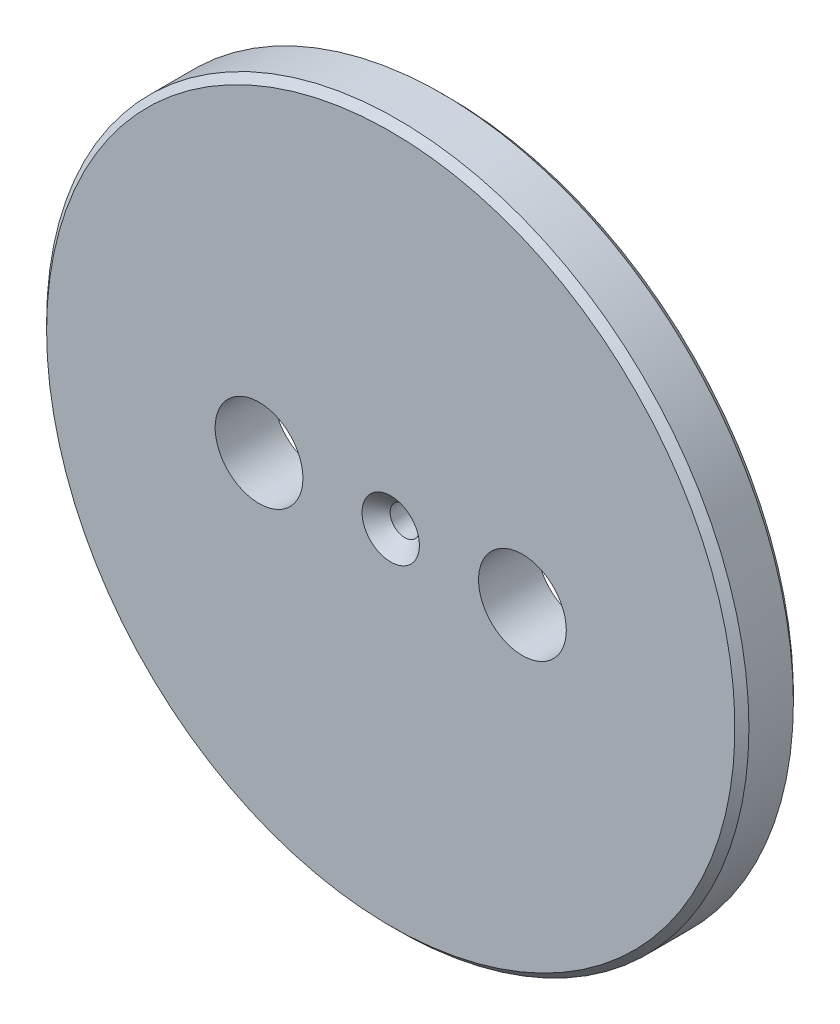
ISO-10303-21;
HEADER;
FILE_DESCRIPTION(('STEP AP214'),'2;1');
FILE_NAME('part.step','',(''),(''),'','','');
FILE_SCHEMA(('AUTOMOTIVE_DESIGN { 1 0 10303 214 1 1 1 1 }'));
ENDSEC;
DATA;
#1=APPLICATION_CONTEXT('core data for automotive mechanical design processes');
#2=APPLICATION_PROTOCOL_DEFINITION('international standard','automotive_design',2000,#1);
#3=PRODUCT_CONTEXT('',#1,'mechanical');
#4=PRODUCT('Part','Part','',(#3));
#5=PRODUCT_RELATED_PRODUCT_CATEGORY('part','',(#4));
#6=PRODUCT_DEFINITION_FORMATION('','',#4);
#7=PRODUCT_DEFINITION_CONTEXT('part definition',#1,'design');
#8=PRODUCT_DEFINITION('design','',#6,#7);
#9=PRODUCT_DEFINITION_SHAPE('','',#8);
#10=(LENGTH_UNIT() NAMED_UNIT(*) SI_UNIT(.MILLI.,.METRE.));
#11=(NAMED_UNIT(*) PLANE_ANGLE_UNIT() SI_UNIT($,.RADIAN.));
#12=(NAMED_UNIT(*) SI_UNIT($,.STERADIAN.) SOLID_ANGLE_UNIT());
#13=UNCERTAINTY_MEASURE_WITH_UNIT(LENGTH_MEASURE(1.E-05),#10,'distance_accuracy_value','');
#14=(GEOMETRIC_REPRESENTATION_CONTEXT(3) GLOBAL_UNCERTAINTY_ASSIGNED_CONTEXT((#13)) GLOBAL_UNIT_ASSIGNED_CONTEXT((#10,
#11,#12)) REPRESENTATION_CONTEXT('',''));
#15=CARTESIAN_POINT('',(0.,0.,0.));
#16=DIRECTION('',(0.,0.,1.));
#17=DIRECTION('',(1.,0.,0.));
#18=AXIS2_PLACEMENT_3D('',#15,#16,#17);
#19=CARTESIAN_POINT('',(0.,0.,4.7625));
#20=DIRECTION('',(0.,0.,0.999999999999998));
#21=DIRECTION('',(1.,0.,0.));
#22=AXIS2_PLACEMENT_3D('',#19,#20,#21);
#23=PLANE('',#22);
#24=CARTESIAN_POINT('',(14.2875,0.,4.7625));
#25=DIRECTION('',(0.,0.,0.999999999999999));
#26=DIRECTION('',(1.,0.,0.));
#27=AXIS2_PLACEMENT_3D('',#24,#25,#26);
#28=CIRCLE('',#27,4.7625);
#29=CARTESIAN_POINT('',(19.05,0.,4.7625));
#30=VERTEX_POINT('',#29);
#31=EDGE_CURVE('E75',#30,#30,#28,.T.);
#32=ORIENTED_EDGE('',*,*,#31,.F.);
#33=EDGE_LOOP('',(#32));
#34=FACE_BOUND('',#33,.T.);
#35=CARTESIAN_POINT('',(-14.2875,0.,4.7625));
#36=DIRECTION('',(0.,0.,0.999999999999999));
#37=DIRECTION('',(1.,0.,0.));
#38=AXIS2_PLACEMENT_3D('',#35,#36,#37);
#39=CIRCLE('',#38,4.7625);
#40=CARTESIAN_POINT('',(-9.525,0.,4.7625));
#41=VERTEX_POINT('',#40);
#42=EDGE_CURVE('E69',#41,#41,#39,.T.);
#43=ORIENTED_EDGE('',*,*,#42,.F.);
#44=EDGE_LOOP('',(#43));
#45=FACE_BOUND('',#44,.T.);
#46=CARTESIAN_POINT('',(0.,0.,4.7625));
#47=DIRECTION('',(0.,0.,0.999999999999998));
#48=DIRECTION('',(1.,0.,0.));
#49=AXIS2_PLACEMENT_3D('',#46,#47,#48);
#50=CIRCLE('',#49,37.338);
#51=CARTESIAN_POINT('',(-37.338,0.,4.7625));
#52=VERTEX_POINT('',#51);
#53=EDGE_CURVE('E10',#52,#52,#50,.T.);
#54=ORIENTED_EDGE('',*,*,#53,.T.);
#55=EDGE_LOOP('',(#54));
#56=FACE_BOUND('',#55,.T.);
#57=CARTESIAN_POINT('',(0.,0.,4.7625));
#58=DIRECTION('',(0.,0.,0.999999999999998));
#59=DIRECTION('',(1.,0.,0.));
#60=AXIS2_PLACEMENT_3D('',#57,#58,#59);
#61=CIRCLE('',#60,3.11150000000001);
#62=CARTESIAN_POINT('',(3.11150000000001,0.,4.7625));
#63=VERTEX_POINT('',#62);
#64=EDGE_CURVE('E51',#63,#63,#61,.F.);
#65=ORIENTED_EDGE('',*,*,#64,.T.);
#66=EDGE_LOOP('',(#65));
#67=FACE_BOUND('',#66,.T.);
#68=ADVANCED_FACE('F31',(#34,#45,#56,#67),#23,.T.);
#69=CARTESIAN_POINT('',(0.,0.,0.));
#70=DIRECTION('',(0.,0.,0.999999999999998));
#71=DIRECTION('',(1.,0.,0.));
#72=AXIS2_PLACEMENT_3D('',#69,#70,#71);
#73=PLANE('',#72);
#74=CARTESIAN_POINT('',(0.,0.,0.));
#75=DIRECTION('',(0.,0.,-0.999999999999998));
#76=DIRECTION('',(-1.,0.,0.));
#77=AXIS2_PLACEMENT_3D('',#74,#75,#76);
#78=CIRCLE('',#77,4.7625);
#79=CARTESIAN_POINT('',(4.7625,0.,0.));
#80=VERTEX_POINT('',#79);
#81=EDGE_CURVE('E63',#80,#80,#78,.T.);
#82=ORIENTED_EDGE('',*,*,#81,.T.);
#83=EDGE_LOOP('',(#82));
#84=FACE_BOUND('',#83,.T.);
#85=CARTESIAN_POINT('',(0.,0.,0.));
#86=DIRECTION('',(0.,0.,0.999999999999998));
#87=DIRECTION('',(1.,0.,0.));
#88=AXIS2_PLACEMENT_3D('',#85,#86,#87);
#89=CIRCLE('',#88,1.5875);
#90=CARTESIAN_POINT('',(-1.5875,0.,0.));
#91=VERTEX_POINT('',#90);
#92=EDGE_CURVE('E57',#91,#91,#89,.T.);
#93=ORIENTED_EDGE('',*,*,#92,.T.);
#94=EDGE_LOOP('',(#93));
#95=FACE_BOUND('',#94,.T.);
#96=ADVANCED_FACE('F83',(#84,#95),#73,.F.);
#97=CARTESIAN_POINT('',(0.,0.,4.7625));
#98=DIRECTION('',(0.,0.,-0.999999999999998));
#99=DIRECTION('',(-1.,0.,0.));
#100=AXIS2_PLACEMENT_3D('',#97,#98,#99);
#101=CYLINDRICAL_SURFACE('',#100,38.1);
#102=CARTESIAN_POINT('',(0.,0.,-0.825500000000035));
#103=DIRECTION('',(0.,0.,-0.999999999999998));
#104=DIRECTION('',(-1.,0.,0.));
#105=AXIS2_PLACEMENT_3D('',#102,#103,#104);
#106=CIRCLE('',#105,38.1);
#107=CARTESIAN_POINT('',(-38.1,0.,-0.825500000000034));
#108=VERTEX_POINT('',#107);
#109=EDGE_CURVE('E38',#108,#108,#106,.F.);
#110=CARTESIAN_POINT('',(0.,0.,4.00049999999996));
#111=DIRECTION('',(0.,0.,0.999999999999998));
#112=DIRECTION('',(1.,0.,0.));
#113=AXIS2_PLACEMENT_3D('',#110,#111,#112);
#114=CIRCLE('',#113,38.1);
#115=CARTESIAN_POINT('',(-38.1,0.,4.00049999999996));
#116=VERTEX_POINT('',#115);
#117=EDGE_CURVE('E42',#116,#116,#114,.F.);
#118=CARTESIAN_POINT('',(-38.1,0.,-0.825500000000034));
#119=CARTESIAN_POINT('',(-38.1,0.,-0.7752291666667));
#120=CARTESIAN_POINT('',(-38.1,0.,-0.724958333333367));
#121=CARTESIAN_POINT('',(-38.1,0.,-0.6244166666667));
#122=CARTESIAN_POINT('',(-38.1,0.,-0.574145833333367));
#123=CARTESIAN_POINT('',(-38.1,0.,-0.4736041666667));
#124=CARTESIAN_POINT('',(-38.1,0.,-0.423333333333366));
#125=CARTESIAN_POINT('',(-38.1,0.,-0.3227916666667));
#126=CARTESIAN_POINT('',(-38.1,0.,-0.272520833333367));
#127=CARTESIAN_POINT('',(-38.1,0.,-0.171979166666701));
#128=CARTESIAN_POINT('',(-38.1,0.,-0.121708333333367));
#129=CARTESIAN_POINT('',(-38.1,0.,-0.0211666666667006));
#130=CARTESIAN_POINT('',(-38.1,0.,0.029104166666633));
#131=CARTESIAN_POINT('',(-38.1,0.,0.1296458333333));
#132=CARTESIAN_POINT('',(-38.1,0.,0.179916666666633));
#133=CARTESIAN_POINT('',(-38.1,0.,0.280458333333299));
#134=CARTESIAN_POINT('',(-38.1,0.,0.330729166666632));
#135=CARTESIAN_POINT('',(-38.1,0.,0.431270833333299));
#136=CARTESIAN_POINT('',(-38.1,0.,0.481541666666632));
#137=CARTESIAN_POINT('',(-38.1,0.,0.582083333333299));
#138=CARTESIAN_POINT('',(-38.1,0.,0.632354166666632));
#139=CARTESIAN_POINT('',(-38.1,0.,0.732895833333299));
#140=CARTESIAN_POINT('',(-38.1,0.,0.783166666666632));
#141=CARTESIAN_POINT('',(-38.1,0.,0.883708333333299));
#142=CARTESIAN_POINT('',(-38.1,0.,0.933979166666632));
#143=CARTESIAN_POINT('',(-38.1,0.,1.0345208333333));
#144=CARTESIAN_POINT('',(-38.1,0.,1.08479166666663));
#145=CARTESIAN_POINT('',(-38.1,0.,1.1853333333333));
#146=CARTESIAN_POINT('',(-38.1,0.,1.23560416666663));
#147=CARTESIAN_POINT('',(-38.1,0.,1.3361458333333));
#148=CARTESIAN_POINT('',(-38.1,0.,1.38641666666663));
#149=CARTESIAN_POINT('',(-38.1,0.,1.4869583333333));
#150=CARTESIAN_POINT('',(-38.1,0.,1.53722916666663));
#151=CARTESIAN_POINT('',(-38.1,0.,1.6377708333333));
#152=CARTESIAN_POINT('',(-38.1,0.,1.68804166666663));
#153=CARTESIAN_POINT('',(-38.1,0.,1.7885833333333));
#154=CARTESIAN_POINT('',(-38.1,0.,1.83885416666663));
#155=CARTESIAN_POINT('',(-38.1,0.,1.9393958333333));
#156=CARTESIAN_POINT('',(-38.1,0.,1.98966666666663));
#157=CARTESIAN_POINT('',(-38.1,0.,2.0902083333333));
#158=CARTESIAN_POINT('',(-38.1,0.,2.14047916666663));
#159=CARTESIAN_POINT('',(-38.1,0.,2.2410208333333));
#160=CARTESIAN_POINT('',(-38.1,0.,2.29129166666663));
#161=CARTESIAN_POINT('',(-38.1,0.,2.3918333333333));
#162=CARTESIAN_POINT('',(-38.1,0.,2.44210416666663));
#163=CARTESIAN_POINT('',(-38.1,0.,2.5426458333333));
#164=CARTESIAN_POINT('',(-38.1,0.,2.59291666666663));
#165=CARTESIAN_POINT('',(-38.1,0.,2.6934583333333));
#166=CARTESIAN_POINT('',(-38.1,0.,2.74372916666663));
#167=CARTESIAN_POINT('',(-38.1,0.,2.8442708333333));
#168=CARTESIAN_POINT('',(-38.1,0.,2.89454166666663));
#169=CARTESIAN_POINT('',(-38.1,0.,2.9950833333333));
#170=CARTESIAN_POINT('',(-38.1,0.,3.04535416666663));
#171=CARTESIAN_POINT('',(-38.1,0.,3.1458958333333));
#172=CARTESIAN_POINT('',(-38.1,0.,3.19616666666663));
#173=CARTESIAN_POINT('',(-38.1,0.,3.2967083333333));
#174=CARTESIAN_POINT('',(-38.1,0.,3.34697916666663));
#175=CARTESIAN_POINT('',(-38.1,0.,3.4475208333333));
#176=CARTESIAN_POINT('',(-38.1,0.,3.49779166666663));
#177=CARTESIAN_POINT('',(-38.1,0.,3.5983333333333));
#178=CARTESIAN_POINT('',(-38.1,0.,3.64860416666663));
#179=CARTESIAN_POINT('',(-38.1,0.,3.7491458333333));
#180=CARTESIAN_POINT('',(-38.1,0.,3.79941666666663));
#181=CARTESIAN_POINT('',(-38.1,0.,3.8999583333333));
#182=CARTESIAN_POINT('',(-38.1,0.,3.95022916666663));
#183=CARTESIAN_POINT('',(-38.1,0.,4.00049999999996));
#184=B_SPLINE_CURVE_WITH_KNOTS('',3,(#118,#119,#120,#121,#122,#123,#124,#125,#126,#127,#128,
#129,#130,#131,#132,#133,#134,#135,#136,#137,#138,#139,#140,#141,#142,#143,#144,#145,#146,#147,
#148,#149,#150,#151,#152,#153,#154,#155,#156,#157,#158,#159,#160,#161,#162,#163,#164,#165,#166,
#167,#168,#169,#170,#171,#172,#173,#174,#175,#176,#177,#178,#179,#180,#181,#182,#183),
.UNSPECIFIED.,.F.,.F.,(4,2,2,2,2,2,2,2,2,2,2,2,2,2,2,2,2,2,2,2,2,2,2,2,2,2,2,2,2,2,2,2,4),(0.,
0.1508125,0.301625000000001,0.452437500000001,0.60325,0.7540625,0.904875,1.0556875,1.2065,
1.3573125,1.508125,1.6589375,1.80975,1.9605625,2.111375,2.2621875,2.413,2.5638125,2.714625,
2.8654375,3.01625,3.1670625,3.317875,3.4686875,3.6195,3.7703125,3.921125,4.0719375,4.22275,
4.3735625,4.524375,4.6751875,4.826),.UNSPECIFIED.);
#185=EDGE_CURVE('BSEAM33',#108,#116,#184,.T.);
#186=ORIENTED_EDGE('',*,*,#109,.T.);
#187=ORIENTED_EDGE('',*,*,#117,.T.);
#188=ORIENTED_EDGE('',*,*,#185,.T.);
#189=ORIENTED_EDGE('',*,*,#185,.F.);
#190=EDGE_LOOP('',(#186,#188,#187,#189));
#191=FACE_BOUND('',#190,.T.);
#192=ADVANCED_FACE('F33',(#191),#101,.T.);
#193=CARTESIAN_POINT('',(0.,0.,4.7625));
#194=DIRECTION('',(0.,0.,-0.999999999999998));
#195=DIRECTION('',(-1.,0.,0.));
#196=AXIS2_PLACEMENT_3D('',#193,#194,#195);
#197=CYLINDRICAL_SURFACE('',#196,1.5875);
#198=CARTESIAN_POINT('',(0.,0.,3.23850000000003));
#199=DIRECTION('',(0.,0.,0.999999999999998));
#200=DIRECTION('',(1.,0.,0.));
#201=AXIS2_PLACEMENT_3D('',#198,#199,#200);
#202=CIRCLE('',#201,1.5875);
#203=CARTESIAN_POINT('',(-1.5875,0.,3.23850000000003));
#204=VERTEX_POINT('',#203);
#205=EDGE_CURVE('E54',#204,#204,#202,.T.);
#206=CARTESIAN_POINT('',(-1.5875,0.,3.23850000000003));
#207=CARTESIAN_POINT('',(-1.5875,0.,3.20476562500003));
#208=CARTESIAN_POINT('',(-1.5875,0.,3.17103125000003));
#209=CARTESIAN_POINT('',(-1.5875,0.,3.10356250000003));
#210=CARTESIAN_POINT('',(-1.5875,0.,3.06982812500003));
#211=CARTESIAN_POINT('',(-1.5875,0.,3.00235937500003));
#212=CARTESIAN_POINT('',(-1.5875,0.,2.96862500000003));
#213=CARTESIAN_POINT('',(-1.5875,0.,2.90115625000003));
#214=CARTESIAN_POINT('',(-1.5875,0.,2.86742187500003));
#215=CARTESIAN_POINT('',(-1.5875,0.,2.79995312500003));
#216=CARTESIAN_POINT('',(-1.5875,0.,2.76621875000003));
#217=CARTESIAN_POINT('',(-1.5875,0.,2.69875000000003));
#218=CARTESIAN_POINT('',(-1.5875,0.,2.66501562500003));
#219=CARTESIAN_POINT('',(-1.5875,0.,2.59754687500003));
#220=CARTESIAN_POINT('',(-1.5875,0.,2.56381250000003));
#221=CARTESIAN_POINT('',(-1.5875,0.,2.49634375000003));
#222=CARTESIAN_POINT('',(-1.5875,0.,2.46260937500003));
#223=CARTESIAN_POINT('',(-1.5875,0.,2.39514062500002));
#224=CARTESIAN_POINT('',(-1.5875,0.,2.36140625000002));
#225=CARTESIAN_POINT('',(-1.5875,0.,2.29393750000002));
#226=CARTESIAN_POINT('',(-1.5875,0.,2.26020312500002));
#227=CARTESIAN_POINT('',(-1.5875,0.,2.19273437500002));
#228=CARTESIAN_POINT('',(-1.5875,0.,2.15900000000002));
#229=CARTESIAN_POINT('',(-1.5875,0.,2.09153125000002));
#230=CARTESIAN_POINT('',(-1.5875,0.,2.05779687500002));
#231=CARTESIAN_POINT('',(-1.5875,0.,1.99032812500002));
#232=CARTESIAN_POINT('',(-1.5875,0.,1.95659375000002));
#233=CARTESIAN_POINT('',(-1.5875,0.,1.88912500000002));
#234=CARTESIAN_POINT('',(-1.5875,0.,1.85539062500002));
#235=CARTESIAN_POINT('',(-1.5875,0.,1.78792187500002));
#236=CARTESIAN_POINT('',(-1.5875,0.,1.75418750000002));
#237=CARTESIAN_POINT('',(-1.5875,0.,1.68671875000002));
#238=CARTESIAN_POINT('',(-1.5875,0.,1.65298437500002));
#239=CARTESIAN_POINT('',(-1.5875,0.,1.58551562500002));
#240=CARTESIAN_POINT('',(-1.5875,0.,1.55178125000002));
#241=CARTESIAN_POINT('',(-1.5875,0.,1.48431250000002));
#242=CARTESIAN_POINT('',(-1.5875,0.,1.45057812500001));
#243=CARTESIAN_POINT('',(-1.5875,0.,1.38310937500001));
#244=CARTESIAN_POINT('',(-1.5875,0.,1.34937500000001));
#245=CARTESIAN_POINT('',(-1.5875,0.,1.28190625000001));
#246=CARTESIAN_POINT('',(-1.5875,0.,1.24817187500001));
#247=CARTESIAN_POINT('',(-1.5875,0.,1.18070312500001));
#248=CARTESIAN_POINT('',(-1.5875,0.,1.14696875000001));
#249=CARTESIAN_POINT('',(-1.5875,0.,1.07950000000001));
#250=CARTESIAN_POINT('',(-1.5875,0.,1.04576562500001));
#251=CARTESIAN_POINT('',(-1.5875,0.,0.97829687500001));
#252=CARTESIAN_POINT('',(-1.5875,0.,0.94456250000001));
#253=CARTESIAN_POINT('',(-1.5875,0.,0.877093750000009));
#254=CARTESIAN_POINT('',(-1.5875,0.,0.843359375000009));
#255=CARTESIAN_POINT('',(-1.5875,0.,0.775890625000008));
#256=CARTESIAN_POINT('',(-1.5875,0.,0.742156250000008));
#257=CARTESIAN_POINT('',(-1.5875,0.,0.674687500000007));
#258=CARTESIAN_POINT('',(-1.5875,0.,0.640953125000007));
#259=CARTESIAN_POINT('',(-1.5875,0.,0.573484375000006));
#260=CARTESIAN_POINT('',(-1.5875,0.,0.539750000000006));
#261=CARTESIAN_POINT('',(-1.5875,0.,0.472281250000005));
#262=CARTESIAN_POINT('',(-1.5875,0.,0.438546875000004));
#263=CARTESIAN_POINT('',(-1.5875,0.,0.371078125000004));
#264=CARTESIAN_POINT('',(-1.5875,0.,0.337343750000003));
#265=CARTESIAN_POINT('',(-1.5875,0.,0.269875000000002));
#266=CARTESIAN_POINT('',(-1.5875,0.,0.236140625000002));
#267=CARTESIAN_POINT('',(-1.5875,0.,0.168671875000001));
#268=CARTESIAN_POINT('',(-1.5875,0.,0.134937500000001));
#269=CARTESIAN_POINT('',(-1.5875,0.,0.0674687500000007));
#270=CARTESIAN_POINT('',(-1.5875,0.,0.0337343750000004));
#271=CARTESIAN_POINT('',(-1.5875,0.,0.));
#272=B_SPLINE_CURVE_WITH_KNOTS('',3,(#206,#207,#208,#209,#210,#211,#212,#213,#214,#215,#216,
#217,#218,#219,#220,#221,#222,#223,#224,#225,#226,#227,#228,#229,#230,#231,#232,#233,#234,#235,
#236,#237,#238,#239,#240,#241,#242,#243,#244,#245,#246,#247,#248,#249,#250,#251,#252,#253,#254,
#255,#256,#257,#258,#259,#260,#261,#262,#263,#264,#265,#266,#267,#268,#269,#270,#271),
.UNSPECIFIED.,.F.,.F.,(4,2,2,2,2,2,2,2,2,2,2,2,2,2,2,2,2,2,2,2,2,2,2,2,2,2,2,2,2,2,2,2,4),(0.,
0.101203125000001,0.202406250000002,0.303609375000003,0.404812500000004,0.506015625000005,
0.607218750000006,0.708421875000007,0.809625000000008,0.910828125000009,1.01203125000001,
1.11323437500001,1.21443750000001,1.31564062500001,1.41684375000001,1.51804687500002,
1.61925000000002,1.72045312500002,1.82165625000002,1.92285937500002,2.02406250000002,
2.12526562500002,2.22646875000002,2.32767187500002,2.42887500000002,2.53007812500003,
2.63128125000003,2.73248437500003,2.83368750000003,2.93489062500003,3.03609375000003,
3.13729687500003,3.23850000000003),.UNSPECIFIED.);
#273=EDGE_CURVE('BSEAM96',#204,#91,#272,.T.);
#274=ORIENTED_EDGE('',*,*,#205,.T.);
#275=ORIENTED_EDGE('',*,*,#92,.F.);
#276=ORIENTED_EDGE('',*,*,#273,.T.);
#277=ORIENTED_EDGE('',*,*,#273,.F.);
#278=EDGE_LOOP('',(#274,#276,#275,#277));
#279=FACE_BOUND('',#278,.T.);
#280=ADVANCED_FACE('F96',(#279),#197,.F.);
#281=CARTESIAN_POINT('',(0.,0.,-1.58749999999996));
#282=DIRECTION('',(0.,0.,-0.999999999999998));
#283=DIRECTION('',(-1.,0.,0.));
#284=AXIS2_PLACEMENT_3D('',#281,#282,#283);
#285=PLANE('',#284);
#286=CARTESIAN_POINT('',(14.2875,0.,-1.58749999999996));
#287=DIRECTION('',(0.,0.,0.999999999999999));
#288=DIRECTION('',(1.,0.,0.));
#289=AXIS2_PLACEMENT_3D('',#286,#287,#288);
#290=CIRCLE('',#289,4.7625);
#291=CARTESIAN_POINT('',(19.05,0.,-1.58749999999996));
#292=VERTEX_POINT('',#291);
#293=EDGE_CURVE('E72',#292,#292,#290,.T.);
#294=ORIENTED_EDGE('',*,*,#293,.T.);
#295=EDGE_LOOP('',(#294));
#296=FACE_BOUND('',#295,.T.);
#297=CARTESIAN_POINT('',(-14.2875,0.,-1.58749999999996));
#298=DIRECTION('',(0.,0.,0.999999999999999));
#299=DIRECTION('',(1.,0.,0.));
#300=AXIS2_PLACEMENT_3D('',#297,#298,#299);
#301=CIRCLE('',#300,4.7625);
#302=CARTESIAN_POINT('',(-9.525,0.,-1.58749999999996));
#303=VERTEX_POINT('',#302);
#304=EDGE_CURVE('E66',#303,#303,#301,.T.);
#305=ORIENTED_EDGE('',*,*,#304,.T.);
#306=EDGE_LOOP('',(#305));
#307=FACE_BOUND('',#306,.T.);
#308=CARTESIAN_POINT('',(0.,0.,-1.58749999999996));
#309=DIRECTION('',(0.,0.,-0.999999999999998));
#310=DIRECTION('',(-1.,0.,0.));
#311=AXIS2_PLACEMENT_3D('',#308,#309,#310);
#312=CIRCLE('',#311,37.338);
#313=CARTESIAN_POINT('',(-37.338,0.,-1.58749999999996));
#314=VERTEX_POINT('',#313);
#315=EDGE_CURVE('E46',#314,#314,#312,.T.);
#316=ORIENTED_EDGE('',*,*,#315,.T.);
#317=EDGE_LOOP('',(#316));
#318=FACE_BOUND('',#317,.T.);
#319=CARTESIAN_POINT('',(0.,0.,-1.58749999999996));
#320=DIRECTION('',(0.,0.,-0.999999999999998));
#321=DIRECTION('',(-1.,0.,0.));
#322=AXIS2_PLACEMENT_3D('',#319,#320,#321);
#323=CIRCLE('',#322,4.7625);
#324=CARTESIAN_POINT('',(4.7625,0.,-1.58749999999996));
#325=VERTEX_POINT('',#324);
#326=EDGE_CURVE('E60',#325,#325,#323,.T.);
#327=ORIENTED_EDGE('',*,*,#326,.F.);
#328=EDGE_LOOP('',(#327));
#329=FACE_BOUND('',#328,.T.);
#330=ADVANCED_FACE('F99',(#296,#307,#318,#329),#285,.T.);
#331=CARTESIAN_POINT('',(0.,0.,-1.58749999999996));
#332=DIRECTION('',(0.,0.,0.999999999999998));
#333=DIRECTION('',(1.,0.,0.));
#334=AXIS2_PLACEMENT_3D('',#331,#332,#333);
#335=CYLINDRICAL_SURFACE('',#334,4.7625);
#336=CARTESIAN_POINT('',(4.7625,0.,-1.58749999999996));
#337=CARTESIAN_POINT('',(4.7625,0.,-1.57096354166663));
#338=CARTESIAN_POINT('',(4.7625,0.,-1.5544270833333));
#339=CARTESIAN_POINT('',(4.7625,0.,-1.52135416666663));
#340=CARTESIAN_POINT('',(4.7625,0.,-1.5048177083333));
#341=CARTESIAN_POINT('',(4.7625,0.,-1.47174479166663));
#342=CARTESIAN_POINT('',(4.7625,0.,-1.4552083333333));
#343=CARTESIAN_POINT('',(4.7625,0.,-1.42213541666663));
#344=CARTESIAN_POINT('',(4.7625,0.,-1.4055989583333));
#345=CARTESIAN_POINT('',(4.7625,0.,-1.37252604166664));
#346=CARTESIAN_POINT('',(4.7625,0.,-1.3559895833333));
#347=CARTESIAN_POINT('',(4.7625,0.,-1.32291666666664));
#348=CARTESIAN_POINT('',(4.7625,0.,-1.3063802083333));
#349=CARTESIAN_POINT('',(4.7625,0.,-1.27330729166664));
#350=CARTESIAN_POINT('',(4.7625,0.,-1.2567708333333));
#351=CARTESIAN_POINT('',(4.7625,0.,-1.22369791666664));
#352=CARTESIAN_POINT('',(4.7625,0.,-1.20716145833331));
#353=CARTESIAN_POINT('',(4.7625,0.,-1.17408854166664));
#354=CARTESIAN_POINT('',(4.7625,0.,-1.15755208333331));
#355=CARTESIAN_POINT('',(4.7625,0.,-1.12447916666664));
#356=CARTESIAN_POINT('',(4.7625,0.,-1.10794270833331));
#357=CARTESIAN_POINT('',(4.7625,0.,-1.07486979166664));
#358=CARTESIAN_POINT('',(4.7625,0.,-1.05833333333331));
#359=CARTESIAN_POINT('',(4.7625,0.,-1.02526041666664));
#360=CARTESIAN_POINT('',(4.7625,0.,-1.00872395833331));
#361=CARTESIAN_POINT('',(4.7625,0.,-0.975651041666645));
#362=CARTESIAN_POINT('',(4.7625,0.,-0.959114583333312));
#363=CARTESIAN_POINT('',(4.7625,0.,-0.926041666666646));
#364=CARTESIAN_POINT('',(4.7625,0.,-0.909505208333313));
#365=CARTESIAN_POINT('',(4.7625,0.,-0.876432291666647));
#366=CARTESIAN_POINT('',(4.7625,0.,-0.859895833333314));
#367=CARTESIAN_POINT('',(4.7625,0.,-0.826822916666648));
#368=CARTESIAN_POINT('',(4.7625,0.,-0.810286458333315));
#369=CARTESIAN_POINT('',(4.7625,0.,-0.777213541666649));
#370=CARTESIAN_POINT('',(4.7625,0.,-0.760677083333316));
#371=CARTESIAN_POINT('',(4.7625,0.,-0.72760416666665));
#372=CARTESIAN_POINT('',(4.7625,0.,-0.711067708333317));
#373=CARTESIAN_POINT('',(4.7625,0.,-0.677994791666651));
#374=CARTESIAN_POINT('',(4.7625,0.,-0.661458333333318));
#375=CARTESIAN_POINT('',(4.7625,0.,-0.628385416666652));
#376=CARTESIAN_POINT('',(4.7625,0.,-0.61184895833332));
#377=CARTESIAN_POINT('',(4.7625,0.,-0.578776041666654));
#378=CARTESIAN_POINT('',(4.7625,0.,-0.562239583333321));
#379=CARTESIAN_POINT('',(4.7625,0.,-0.529166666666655));
#380=CARTESIAN_POINT('',(4.7625,0.,-0.512630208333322));
#381=CARTESIAN_POINT('',(4.7625,0.,-0.479557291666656));
#382=CARTESIAN_POINT('',(4.7625,0.,-0.463020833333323));
#383=CARTESIAN_POINT('',(4.7625,0.,-0.429947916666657));
#384=CARTESIAN_POINT('',(4.7625,0.,-0.413411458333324));
#385=CARTESIAN_POINT('',(4.7625,0.,-0.380338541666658));
#386=CARTESIAN_POINT('',(4.7625,0.,-0.363802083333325));
#387=CARTESIAN_POINT('',(4.7625,0.,-0.330729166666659));
#388=CARTESIAN_POINT('',(4.7625,0.,-0.314192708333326));
#389=CARTESIAN_POINT('',(4.7625,0.,-0.28111979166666));
#390=CARTESIAN_POINT('',(4.7625,0.,-0.264583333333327));
#391=CARTESIAN_POINT('',(4.7625,0.,-0.231510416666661));
#392=CARTESIAN_POINT('',(4.7625,0.,-0.214973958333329));
#393=CARTESIAN_POINT('',(4.7625,0.,-0.181901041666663));
#394=CARTESIAN_POINT('',(4.7625,0.,-0.16536458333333));
#395=CARTESIAN_POINT('',(4.7625,0.,-0.132291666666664));
#396=CARTESIAN_POINT('',(4.7625,0.,-0.115755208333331));
#397=CARTESIAN_POINT('',(4.7625,0.,-0.0826822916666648));
#398=CARTESIAN_POINT('',(4.7625,0.,-0.0661458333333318));
#399=CARTESIAN_POINT('',(4.7625,0.,-0.0330729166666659));
#400=CARTESIAN_POINT('',(4.7625,0.,-0.016536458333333));
#401=CARTESIAN_POINT('',(4.7625,0.,0.));
#402=B_SPLINE_CURVE_WITH_KNOTS('',3,(#336,#337,#338,#339,#340,#341,#342,#343,#344,#345,#346,
#347,#348,#349,#350,#351,#352,#353,#354,#355,#356,#357,#358,#359,#360,#361,#362,#363,#364,#365,
#366,#367,#368,#369,#370,#371,#372,#373,#374,#375,#376,#377,#378,#379,#380,#381,#382,#383,#384,
#385,#386,#387,#388,#389,#390,#391,#392,#393,#394,#395,#396,#397,#398,#399,#400,#401),
.UNSPECIFIED.,.F.,.F.,(4,2,2,2,2,2,2,2,2,2,2,2,2,2,2,2,2,2,2,2,2,2,2,2,2,2,2,2,2,2,2,2,4),(0.,
0.0496093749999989,0.0992187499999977,0.148828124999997,0.198437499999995,0.248046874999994,
0.297656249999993,0.347265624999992,0.396874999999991,0.44648437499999,0.496093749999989,
0.545703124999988,0.595312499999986,0.644921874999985,0.694531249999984,0.744140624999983,
0.793749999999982,0.843359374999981,0.89296874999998,0.942578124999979,0.992187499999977,
1.04179687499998,1.09140624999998,1.14101562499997,1.19062499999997,1.24023437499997,
1.28984374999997,1.33945312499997,1.38906249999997,1.43867187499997,1.48828124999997,
1.53789062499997,1.58749999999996),.UNSPECIFIED.);
#403=EDGE_CURVE('BSEAM92',#325,#80,#402,.T.);
#404=ORIENTED_EDGE('',*,*,#326,.T.);
#405=ORIENTED_EDGE('',*,*,#81,.F.);
#406=ORIENTED_EDGE('',*,*,#403,.T.);
#407=ORIENTED_EDGE('',*,*,#403,.F.);
#408=EDGE_LOOP('',(#404,#406,#405,#407));
#409=FACE_BOUND('',#408,.T.);
#410=ADVANCED_FACE('F92',(#409),#335,.F.);
#411=CARTESIAN_POINT('',(0.,0.,3.23850000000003));
#412=DIRECTION('',(0.,0.,0.999999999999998));
#413=DIRECTION('',(1.,0.,0.));
#414=AXIS2_PLACEMENT_3D('',#411,#412,#413);
#415=CONICAL_SURFACE('',#414,1.5875,0.78539816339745);
#416=ORIENTED_EDGE('',*,*,#64,.F.);
#417=EDGE_LOOP('',(#416));
#418=FACE_BOUND('',#417,.T.);
#419=ORIENTED_EDGE('',*,*,#205,.F.);
#420=EDGE_LOOP('',(#419));
#421=FACE_BOUND('',#420,.T.);
#422=ADVANCED_FACE('F88',(#418,#421),#415,.F.);
#423=CARTESIAN_POINT('',(0.,0.,-1.58749999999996));
#424=DIRECTION('',(0.,0.,0.999999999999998));
#425=DIRECTION('',(1.,0.,0.));
#426=AXIS2_PLACEMENT_3D('',#423,#424,#425);
#427=CONICAL_SURFACE('',#426,37.338,0.785398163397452);
#428=ORIENTED_EDGE('',*,*,#109,.F.);
#429=EDGE_LOOP('',(#428));
#430=FACE_BOUND('',#429,.T.);
#431=ORIENTED_EDGE('',*,*,#315,.F.);
#432=EDGE_LOOP('',(#431));
#433=FACE_BOUND('',#432,.T.);
#434=ADVANCED_FACE('F91',(#430,#433),#427,.T.);
#435=CARTESIAN_POINT('',(0.,0.,4.7625));
#436=DIRECTION('',(0.,0.,-0.999999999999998));
#437=DIRECTION('',(-1.,0.,0.));
#438=AXIS2_PLACEMENT_3D('',#435,#436,#437);
#439=CONICAL_SURFACE('',#438,37.338,0.785398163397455);
#440=CARTESIAN_POINT('',(-38.1000000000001,0.,4.00049999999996));
#441=CARTESIAN_POINT('',(-38.0920625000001,0.,4.00843749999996));
#442=CARTESIAN_POINT('',(-38.084125,0.,4.01637499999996));
#443=CARTESIAN_POINT('',(-38.06825,0.,4.03224999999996));
#444=CARTESIAN_POINT('',(-38.0603125,0.,4.04018749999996));
#445=CARTESIAN_POINT('',(-38.0444375,0.,4.05606249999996));
#446=CARTESIAN_POINT('',(-38.0365,0.,4.06399999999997));
#447=CARTESIAN_POINT('',(-38.020625,0.,4.07987499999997));
#448=CARTESIAN_POINT('',(-38.0126875,0.,4.08781249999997));
#449=CARTESIAN_POINT('',(-37.9968125,0.,4.10368749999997));
#450=CARTESIAN_POINT('',(-37.988875,0.,4.11162499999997));
#451=CARTESIAN_POINT('',(-37.973,0.,4.12749999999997));
#452=CARTESIAN_POINT('',(-37.9650625,0.,4.13543749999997));
#453=CARTESIAN_POINT('',(-37.9491875,0.,4.15131249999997));
#454=CARTESIAN_POINT('',(-37.94125,0.,4.15924999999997));
#455=CARTESIAN_POINT('',(-37.925375,0.,4.17512499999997));
#456=CARTESIAN_POINT('',(-37.9174375,0.,4.18306249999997));
#457=CARTESIAN_POINT('',(-37.9015625,0.,4.19893749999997));
#458=CARTESIAN_POINT('',(-37.893625,0.,4.20687499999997));
#459=CARTESIAN_POINT('',(-37.87775,0.,4.22274999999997));
#460=CARTESIAN_POINT('',(-37.8698125,0.,4.23068749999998));
#461=CARTESIAN_POINT('',(-37.8539375,0.,4.24656249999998));
#462=CARTESIAN_POINT('',(-37.846,0.,4.25449999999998));
#463=CARTESIAN_POINT('',(-37.830125,0.,4.27037499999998));
#464=CARTESIAN_POINT('',(-37.8221875,0.,4.27831249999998));
#465=CARTESIAN_POINT('',(-37.8063125,0.,4.29418749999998));
#466=CARTESIAN_POINT('',(-37.798375,0.,4.30212499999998));
#467=CARTESIAN_POINT('',(-37.7825,0.,4.31799999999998));
#468=CARTESIAN_POINT('',(-37.7745625,0.,4.32593749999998));
#469=CARTESIAN_POINT('',(-37.7586875,0.,4.34181249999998));
#470=CARTESIAN_POINT('',(-37.75075,0.,4.34974999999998));
#471=CARTESIAN_POINT('',(-37.734875,0.,4.36562499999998));
#472=CARTESIAN_POINT('',(-37.7269375,0.,4.37356249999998));
#473=CARTESIAN_POINT('',(-37.7110625,0.,4.38943749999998));
#474=CARTESIAN_POINT('',(-37.703125,0.,4.39737499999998));
#475=CARTESIAN_POINT('',(-37.68725,0.,4.41324999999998));
#476=CARTESIAN_POINT('',(-37.6793125,0.,4.42118749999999));
#477=CARTESIAN_POINT('',(-37.6634375,0.,4.43706249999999));
#478=CARTESIAN_POINT('',(-37.6555,0.,4.44499999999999));
#479=CARTESIAN_POINT('',(-37.639625,0.,4.46087499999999));
#480=CARTESIAN_POINT('',(-37.6316875,0.,4.46881249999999));
#481=CARTESIAN_POINT('',(-37.6158125,0.,4.48468749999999));
#482=CARTESIAN_POINT('',(-37.607875,0.,4.49262499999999));
#483=CARTESIAN_POINT('',(-37.592,0.,4.50849999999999));
#484=CARTESIAN_POINT('',(-37.5840625,0.,4.51643749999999));
#485=CARTESIAN_POINT('',(-37.5681875,0.,4.53231249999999));
#486=CARTESIAN_POINT('',(-37.56025,0.,4.54024999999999));
#487=CARTESIAN_POINT('',(-37.544375,0.,4.55612499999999));
#488=CARTESIAN_POINT('',(-37.5364375,0.,4.56406249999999));
#489=CARTESIAN_POINT('',(-37.5205625,0.,4.57993749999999));
#490=CARTESIAN_POINT('',(-37.512625,0.,4.58787499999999));
#491=CARTESIAN_POINT('',(-37.49675,0.,4.60375));
#492=CARTESIAN_POINT('',(-37.4888125,0.,4.6116875));
#493=CARTESIAN_POINT('',(-37.4729375,0.,4.6275625));
#494=CARTESIAN_POINT('',(-37.465,0.,4.6355));
#495=CARTESIAN_POINT('',(-37.449125,0.,4.651375));
#496=CARTESIAN_POINT('',(-37.4411875,0.,4.6593125));
#497=CARTESIAN_POINT('',(-37.4253125,0.,4.6751875));
#498=CARTESIAN_POINT('',(-37.417375,0.,4.683125));
#499=CARTESIAN_POINT('',(-37.4015,0.,4.699));
#500=CARTESIAN_POINT('',(-37.3935625,0.,4.7069375));
#501=CARTESIAN_POINT('',(-37.3776875,0.,4.7228125));
#502=CARTESIAN_POINT('',(-37.36975,0.,4.73075));
#503=CARTESIAN_POINT('',(-37.353875,0.,4.746625));
#504=CARTESIAN_POINT('',(-37.3459375,0.,4.7545625));
#505=CARTESIAN_POINT('',(-37.338,0.,4.7625));
#506=B_SPLINE_CURVE_WITH_KNOTS('',3,(#440,#441,#442,#443,#444,#445,#446,#447,#448,#449,#450,
#451,#452,#453,#454,#455,#456,#457,#458,#459,#460,#461,#462,#463,#464,#465,#466,#467,#468,#469,
#470,#471,#472,#473,#474,#475,#476,#477,#478,#479,#480,#481,#482,#483,#484,#485,#486,#487,#488,
#489,#490,#491,#492,#493,#494,#495,#496,#497,#498,#499,#500,#501,#502,#503,#504,#505),
.UNSPECIFIED.,.F.,.F.,(4,2,2,2,2,2,2,2,2,2,2,2,2,2,2,2,2,2,2,2,2,2,2,2,2,2,2,2,2,2,2,2,4),(0.,
0.0336759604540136,0.0673519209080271,0.101027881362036,0.134703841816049,0.168379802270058,
0.202055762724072,0.23573172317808,0.269407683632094,0.303083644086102,0.336759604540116,
0.37043556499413,0.404111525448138,0.437787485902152,0.47146344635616,0.505139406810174,
0.538815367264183,0.572491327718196,0.606167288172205,0.639843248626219,0.673519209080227,
0.707195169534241,0.740871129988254,0.774547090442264,0.808223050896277,0.841899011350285,
0.875574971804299,0.909250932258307,0.942926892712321,0.97660285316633,1.01027881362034,
1.04395477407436,1.07763073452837),.UNSPECIFIED.);
#507=EDGE_CURVE('BSEAM118',#116,#52,#506,.T.);
#508=ORIENTED_EDGE('',*,*,#117,.F.);
#509=ORIENTED_EDGE('',*,*,#53,.F.);
#510=ORIENTED_EDGE('',*,*,#507,.T.);
#511=ORIENTED_EDGE('',*,*,#507,.F.);
#512=EDGE_LOOP('',(#508,#510,#509,#511));
#513=FACE_BOUND('',#512,.T.);
#514=ADVANCED_FACE('F118',(#513),#439,.T.);
#515=CARTESIAN_POINT('',(-14.2875,0.,-1.58749999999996));
#516=DIRECTION('',(0.,0.,0.999999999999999));
#517=DIRECTION('',(1.,0.,0.));
#518=AXIS2_PLACEMENT_3D('',#515,#516,#517);
#519=CYLINDRICAL_SURFACE('',#518,4.7625);
#520=CARTESIAN_POINT('',(-9.525,0.,-1.58749999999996));
#521=CARTESIAN_POINT('',(-9.525,0.,-1.52135416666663));
#522=CARTESIAN_POINT('',(-9.525,0.,-1.4552083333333));
#523=CARTESIAN_POINT('',(-9.525,0.,-1.32291666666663));
#524=CARTESIAN_POINT('',(-9.525,0.,-1.2567708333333));
#525=CARTESIAN_POINT('',(-9.525,0.,-1.12447916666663));
#526=CARTESIAN_POINT('',(-9.525,0.,-1.0583333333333));
#527=CARTESIAN_POINT('',(-9.525,0.,-0.926041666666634));
#528=CARTESIAN_POINT('',(-9.525,0.,-0.859895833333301));
#529=CARTESIAN_POINT('',(-9.525,0.,-0.727604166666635));
#530=CARTESIAN_POINT('',(-9.525,0.,-0.661458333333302));
#531=CARTESIAN_POINT('',(-9.525,0.,-0.529166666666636));
#532=CARTESIAN_POINT('',(-9.525,0.,-0.463020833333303));
#533=CARTESIAN_POINT('',(-9.525,0.,-0.330729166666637));
#534=CARTESIAN_POINT('',(-9.525,0.,-0.264583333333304));
#535=CARTESIAN_POINT('',(-9.525,0.,-0.132291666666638));
#536=CARTESIAN_POINT('',(-9.525,0.,-0.0661458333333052));
#537=CARTESIAN_POINT('',(-9.525,0.,0.0661458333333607));
#538=CARTESIAN_POINT('',(-9.525,0.,0.132291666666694));
#539=CARTESIAN_POINT('',(-9.525,0.,0.26458333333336));
#540=CARTESIAN_POINT('',(-9.525,0.,0.330729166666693));
#541=CARTESIAN_POINT('',(-9.525,0.,0.463020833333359));
#542=CARTESIAN_POINT('',(-9.525,0.,0.529166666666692));
#543=CARTESIAN_POINT('',(-9.525,0.,0.661458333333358));
#544=CARTESIAN_POINT('',(-9.525,0.,0.727604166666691));
#545=CARTESIAN_POINT('',(-9.525,0.,0.859895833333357));
#546=CARTESIAN_POINT('',(-9.525,0.,0.92604166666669));
#547=CARTESIAN_POINT('',(-9.525,0.,1.05833333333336));
#548=CARTESIAN_POINT('',(-9.525,0.,1.12447916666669));
#549=CARTESIAN_POINT('',(-9.525,0.,1.25677083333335));
#550=CARTESIAN_POINT('',(-9.525,0.,1.32291666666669));
#551=CARTESIAN_POINT('',(-9.525,0.,1.45520833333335));
#552=CARTESIAN_POINT('',(-9.525,0.,1.52135416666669));
#553=CARTESIAN_POINT('',(-9.525,0.,1.65364583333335));
#554=CARTESIAN_POINT('',(-9.525,0.,1.71979166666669));
#555=CARTESIAN_POINT('',(-9.525,0.,1.85208333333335));
#556=CARTESIAN_POINT('',(-9.525,0.,1.91822916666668));
#557=CARTESIAN_POINT('',(-9.525,0.,2.05052083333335));
#558=CARTESIAN_POINT('',(-9.525,0.,2.11666666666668));
#559=CARTESIAN_POINT('',(-9.525,0.,2.24895833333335));
#560=CARTESIAN_POINT('',(-9.525,0.,2.31510416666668));
#561=CARTESIAN_POINT('',(-9.525,0.,2.44739583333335));
#562=CARTESIAN_POINT('',(-9.525,0.,2.51354166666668));
#563=CARTESIAN_POINT('',(-9.525,0.,2.64583333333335));
#564=CARTESIAN_POINT('',(-9.525,0.,2.71197916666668));
#565=CARTESIAN_POINT('',(-9.525,0.,2.84427083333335));
#566=CARTESIAN_POINT('',(-9.525,0.,2.91041666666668));
#567=CARTESIAN_POINT('',(-9.525,0.,3.04270833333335));
#568=CARTESIAN_POINT('',(-9.525,0.,3.10885416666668));
#569=CARTESIAN_POINT('',(-9.525,0.,3.24114583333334));
#570=CARTESIAN_POINT('',(-9.525,0.,3.30729166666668));
#571=CARTESIAN_POINT('',(-9.525,0.,3.43958333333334));
#572=CARTESIAN_POINT('',(-9.525,0.,3.50572916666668));
#573=CARTESIAN_POINT('',(-9.525,0.,3.63802083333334));
#574=CARTESIAN_POINT('',(-9.525,0.,3.70416666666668));
#575=CARTESIAN_POINT('',(-9.525,0.,3.83645833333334));
#576=CARTESIAN_POINT('',(-9.525,0.,3.90260416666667));
#577=CARTESIAN_POINT('',(-9.525,0.,4.03489583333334));
#578=CARTESIAN_POINT('',(-9.525,0.,4.10104166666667));
#579=CARTESIAN_POINT('',(-9.525,0.,4.23333333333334));
#580=CARTESIAN_POINT('',(-9.525,0.,4.29947916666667));
#581=CARTESIAN_POINT('',(-9.525,0.,4.43177083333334));
#582=CARTESIAN_POINT('',(-9.525,0.,4.49791666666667));
#583=CARTESIAN_POINT('',(-9.525,0.,4.63020833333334));
#584=CARTESIAN_POINT('',(-9.525,0.,4.69635416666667));
#585=CARTESIAN_POINT('',(-9.525,0.,4.7625));
#586=B_SPLINE_CURVE_WITH_KNOTS('',3,(#520,#521,#522,#523,#524,#525,#526,#527,#528,#529,#530,
#531,#532,#533,#534,#535,#536,#537,#538,#539,#540,#541,#542,#543,#544,#545,#546,#547,#548,#549,
#550,#551,#552,#553,#554,#555,#556,#557,#558,#559,#560,#561,#562,#563,#564,#565,#566,#567,#568,
#569,#570,#571,#572,#573,#574,#575,#576,#577,#578,#579,#580,#581,#582,#583,#584,#585),
.UNSPECIFIED.,.F.,.F.,(4,2,2,2,2,2,2,2,2,2,2,2,2,2,2,2,2,2,2,2,2,2,2,2,2,2,2,2,2,2,2,2,4),(0.,
0.198437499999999,0.396874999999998,0.595312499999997,0.793749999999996,0.992187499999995,
1.19062499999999,1.38906249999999,1.58749999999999,1.78593749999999,1.98437499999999,
2.18281249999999,2.38124999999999,2.57968749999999,2.77812499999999,2.97656249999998,
3.17499999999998,3.37343749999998,3.57187499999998,3.77031249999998,3.96874999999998,
4.16718749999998,4.36562499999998,4.56406249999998,4.76249999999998,4.96093749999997,
5.15937499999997,5.35781249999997,5.55624999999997,5.75468749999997,5.95312499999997,
6.15156249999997,6.34999999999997),.UNSPECIFIED.);
#587=EDGE_CURVE('BSEAM122',#303,#41,#586,.T.);
#588=ORIENTED_EDGE('',*,*,#304,.F.);
#589=ORIENTED_EDGE('',*,*,#42,.T.);
#590=ORIENTED_EDGE('',*,*,#587,.T.);
#591=ORIENTED_EDGE('',*,*,#587,.F.);
#592=EDGE_LOOP('',(#588,#590,#589,#591));
#593=FACE_BOUND('',#592,.T.);
#594=ADVANCED_FACE('F122',(#593),#519,.F.);
#595=CARTESIAN_POINT('',(14.2875,0.,-1.58749999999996));
#596=DIRECTION('',(0.,0.,0.999999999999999));
#597=DIRECTION('',(1.,0.,0.));
#598=AXIS2_PLACEMENT_3D('',#595,#596,#597);
#599=CYLINDRICAL_SURFACE('',#598,4.7625);
#600=CARTESIAN_POINT('',(19.05,0.,-1.58749999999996));
#601=CARTESIAN_POINT('',(19.05,0.,-1.52135416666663));
#602=CARTESIAN_POINT('',(19.05,0.,-1.4552083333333));
#603=CARTESIAN_POINT('',(19.05,0.,-1.32291666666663));
#604=CARTESIAN_POINT('',(19.05,0.,-1.2567708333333));
#605=CARTESIAN_POINT('',(19.05,0.,-1.12447916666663));
#606=CARTESIAN_POINT('',(19.05,0.,-1.0583333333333));
#607=CARTESIAN_POINT('',(19.05,0.,-0.926041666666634));
#608=CARTESIAN_POINT('',(19.05,0.,-0.859895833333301));
#609=CARTESIAN_POINT('',(19.05,0.,-0.727604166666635));
#610=CARTESIAN_POINT('',(19.05,0.,-0.661458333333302));
#611=CARTESIAN_POINT('',(19.05,0.,-0.529166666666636));
#612=CARTESIAN_POINT('',(19.05,0.,-0.463020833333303));
#613=CARTESIAN_POINT('',(19.05,0.,-0.330729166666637));
#614=CARTESIAN_POINT('',(19.05,0.,-0.264583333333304));
#615=CARTESIAN_POINT('',(19.05,0.,-0.132291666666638));
#616=CARTESIAN_POINT('',(19.05,0.,-0.0661458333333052));
#617=CARTESIAN_POINT('',(19.05,0.,0.0661458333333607));
#618=CARTESIAN_POINT('',(19.05,0.,0.132291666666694));
#619=CARTESIAN_POINT('',(19.05,0.,0.26458333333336));
#620=CARTESIAN_POINT('',(19.05,0.,0.330729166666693));
#621=CARTESIAN_POINT('',(19.05,0.,0.463020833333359));
#622=CARTESIAN_POINT('',(19.05,0.,0.529166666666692));
#623=CARTESIAN_POINT('',(19.05,0.,0.661458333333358));
#624=CARTESIAN_POINT('',(19.05,0.,0.727604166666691));
#625=CARTESIAN_POINT('',(19.05,0.,0.859895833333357));
#626=CARTESIAN_POINT('',(19.05,0.,0.92604166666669));
#627=CARTESIAN_POINT('',(19.05,0.,1.05833333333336));
#628=CARTESIAN_POINT('',(19.05,0.,1.12447916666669));
#629=CARTESIAN_POINT('',(19.05,0.,1.25677083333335));
#630=CARTESIAN_POINT('',(19.05,0.,1.32291666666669));
#631=CARTESIAN_POINT('',(19.05,0.,1.45520833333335));
#632=CARTESIAN_POINT('',(19.05,0.,1.52135416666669));
#633=CARTESIAN_POINT('',(19.05,0.,1.65364583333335));
#634=CARTESIAN_POINT('',(19.05,0.,1.71979166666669));
#635=CARTESIAN_POINT('',(19.05,0.,1.85208333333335));
#636=CARTESIAN_POINT('',(19.05,0.,1.91822916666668));
#637=CARTESIAN_POINT('',(19.05,0.,2.05052083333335));
#638=CARTESIAN_POINT('',(19.05,0.,2.11666666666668));
#639=CARTESIAN_POINT('',(19.05,0.,2.24895833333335));
#640=CARTESIAN_POINT('',(19.05,0.,2.31510416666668));
#641=CARTESIAN_POINT('',(19.05,0.,2.44739583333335));
#642=CARTESIAN_POINT('',(19.05,0.,2.51354166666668));
#643=CARTESIAN_POINT('',(19.05,0.,2.64583333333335));
#644=CARTESIAN_POINT('',(19.05,0.,2.71197916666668));
#645=CARTESIAN_POINT('',(19.05,0.,2.84427083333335));
#646=CARTESIAN_POINT('',(19.05,0.,2.91041666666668));
#647=CARTESIAN_POINT('',(19.05,0.,3.04270833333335));
#648=CARTESIAN_POINT('',(19.05,0.,3.10885416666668));
#649=CARTESIAN_POINT('',(19.05,0.,3.24114583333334));
#650=CARTESIAN_POINT('',(19.05,0.,3.30729166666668));
#651=CARTESIAN_POINT('',(19.05,0.,3.43958333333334));
#652=CARTESIAN_POINT('',(19.05,0.,3.50572916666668));
#653=CARTESIAN_POINT('',(19.05,0.,3.63802083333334));
#654=CARTESIAN_POINT('',(19.05,0.,3.70416666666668));
#655=CARTESIAN_POINT('',(19.05,0.,3.83645833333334));
#656=CARTESIAN_POINT('',(19.05,0.,3.90260416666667));
#657=CARTESIAN_POINT('',(19.05,0.,4.03489583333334));
#658=CARTESIAN_POINT('',(19.05,0.,4.10104166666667));
#659=CARTESIAN_POINT('',(19.05,0.,4.23333333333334));
#660=CARTESIAN_POINT('',(19.05,0.,4.29947916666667));
#661=CARTESIAN_POINT('',(19.05,0.,4.43177083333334));
#662=CARTESIAN_POINT('',(19.05,0.,4.49791666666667));
#663=CARTESIAN_POINT('',(19.05,0.,4.63020833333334));
#664=CARTESIAN_POINT('',(19.05,0.,4.69635416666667));
#665=CARTESIAN_POINT('',(19.05,0.,4.7625));
#666=B_SPLINE_CURVE_WITH_KNOTS('',3,(#600,#601,#602,#603,#604,#605,#606,#607,#608,#609,#610,
#611,#612,#613,#614,#615,#616,#617,#618,#619,#620,#621,#622,#623,#624,#625,#626,#627,#628,#629,
#630,#631,#632,#633,#634,#635,#636,#637,#638,#639,#640,#641,#642,#643,#644,#645,#646,#647,#648,
#649,#650,#651,#652,#653,#654,#655,#656,#657,#658,#659,#660,#661,#662,#663,#664,#665),
.UNSPECIFIED.,.F.,.F.,(4,2,2,2,2,2,2,2,2,2,2,2,2,2,2,2,2,2,2,2,2,2,2,2,2,2,2,2,2,2,2,2,4),(0.,
0.198437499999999,0.396874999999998,0.595312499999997,0.793749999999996,0.992187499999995,
1.19062499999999,1.38906249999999,1.58749999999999,1.78593749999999,1.98437499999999,
2.18281249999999,2.38124999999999,2.57968749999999,2.77812499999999,2.97656249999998,
3.17499999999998,3.37343749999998,3.57187499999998,3.77031249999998,3.96874999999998,
4.16718749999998,4.36562499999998,4.56406249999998,4.76249999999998,4.96093749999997,
5.15937499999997,5.35781249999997,5.55624999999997,5.75468749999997,5.95312499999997,
6.15156249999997,6.34999999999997),.UNSPECIFIED.);
#667=EDGE_CURVE('BSEAM79',#292,#30,#666,.T.);
#668=ORIENTED_EDGE('',*,*,#293,.F.);
#669=ORIENTED_EDGE('',*,*,#31,.T.);
#670=ORIENTED_EDGE('',*,*,#667,.T.);
#671=ORIENTED_EDGE('',*,*,#667,.F.);
#672=EDGE_LOOP('',(#668,#670,#669,#671));
#673=FACE_BOUND('',#672,.T.);
#674=ADVANCED_FACE('F79',(#673),#599,.F.);
#675=CLOSED_SHELL('',(#68,#96,#192,#280,#330,#410,#422,#434,#514,#594,#674));
#676=MANIFOLD_SOLID_BREP('B2',#675);
#677=ADVANCED_BREP_SHAPE_REPRESENTATION('',(#18,#676),#14);
#678=SHAPE_DEFINITION_REPRESENTATION(#9,#677);
ENDSEC;
END-ISO-10303-21;
